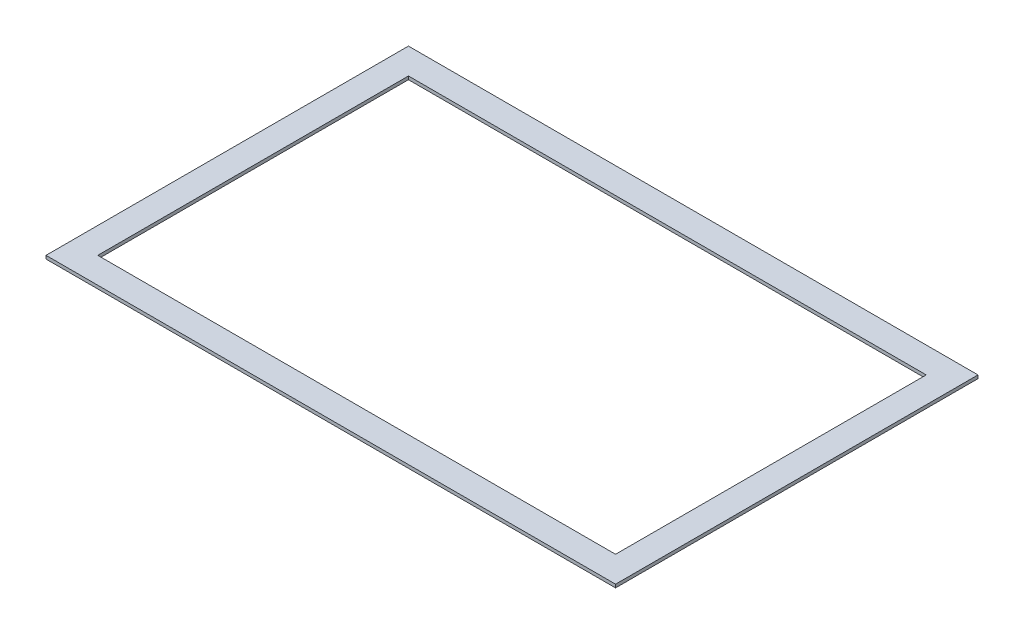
from build123d import *

# Parameters (mm, degrees)
SKETCH1_W      = 279.4
SKETCH1_H      = 177.8
SKETCH1_W_2    = 254
SKETCH1_H_2    = 152.4
EXTRUDE1_DEPTH = 1.6002


with BuildPart() as part:
    # Sketch1 → Extrude1 (new body)
    with BuildSketch(Plane(origin=(0, 0, 0), x_dir=(1, 0, 0), z_dir=(0, 1, 0))):
        with Locations((127, 76.2)):
            Rectangle(SKETCH1_W, SKETCH1_H)
        with Locations((127, 76.2)):
            Rectangle(SKETCH1_W_2, SKETCH1_H_2, mode=Mode.SUBTRACT)
    extrude(amount=EXTRUDE1_DEPTH)


solid = part.part
